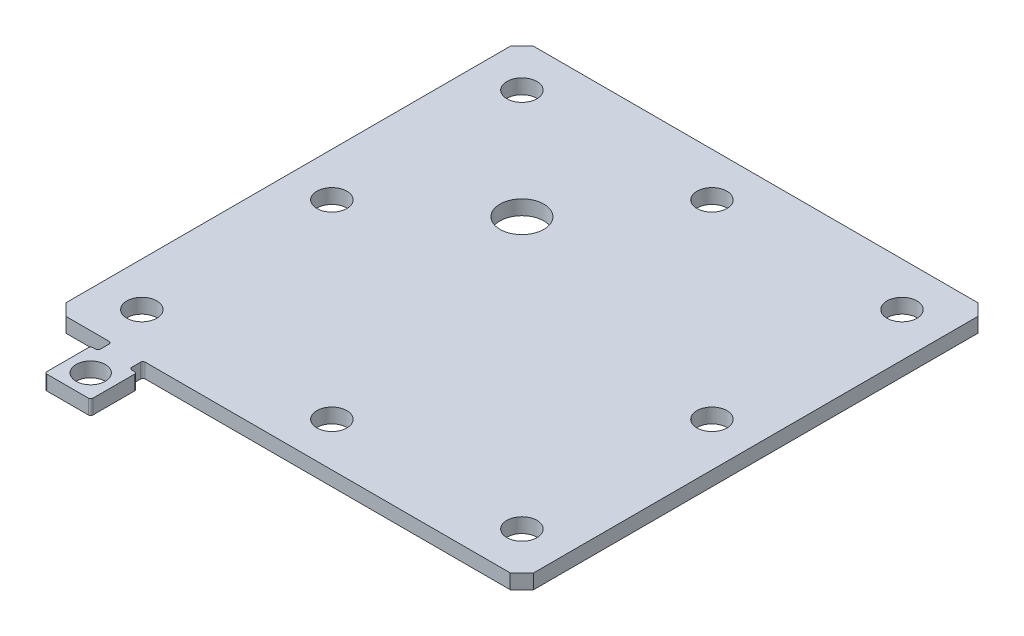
ISO-10303-21;
HEADER;
FILE_DESCRIPTION(('STEP AP214'),'2;1');
FILE_NAME('part.step','',(''),(''),'','','');
FILE_SCHEMA(('AUTOMOTIVE_DESIGN { 1 0 10303 214 1 1 1 1 }'));
ENDSEC;
DATA;
#1=APPLICATION_CONTEXT('core data for automotive mechanical design processes');
#2=APPLICATION_PROTOCOL_DEFINITION('international standard','automotive_design',2000,#1);
#3=PRODUCT_CONTEXT('',#1,'mechanical');
#4=PRODUCT('Part','Part','',(#3));
#5=PRODUCT_RELATED_PRODUCT_CATEGORY('part','',(#4));
#6=PRODUCT_DEFINITION_FORMATION('','',#4);
#7=PRODUCT_DEFINITION_CONTEXT('part definition',#1,'design');
#8=PRODUCT_DEFINITION('design','',#6,#7);
#9=PRODUCT_DEFINITION_SHAPE('','',#8);
#10=(LENGTH_UNIT() NAMED_UNIT(*) SI_UNIT(.MILLI.,.METRE.));
#11=(NAMED_UNIT(*) PLANE_ANGLE_UNIT() SI_UNIT($,.RADIAN.));
#12=(NAMED_UNIT(*) SI_UNIT($,.STERADIAN.) SOLID_ANGLE_UNIT());
#13=UNCERTAINTY_MEASURE_WITH_UNIT(LENGTH_MEASURE(1.E-05),#10,'distance_accuracy_value','');
#14=(GEOMETRIC_REPRESENTATION_CONTEXT(3) GLOBAL_UNCERTAINTY_ASSIGNED_CONTEXT((#13)) GLOBAL_UNIT_ASSIGNED_CONTEXT((#10,
#11,#12)) REPRESENTATION_CONTEXT('',''));
#15=CARTESIAN_POINT('',(0.,0.,0.));
#16=DIRECTION('',(0.,0.,1.));
#17=DIRECTION('',(1.,0.,0.));
#18=AXIS2_PLACEMENT_3D('',#15,#16,#17);
#19=CARTESIAN_POINT('',(46.012230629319,3.175,44.6508696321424));
#20=DIRECTION('',(0.,1.,0.));
#21=DIRECTION('',(0.,0.,1.));
#22=AXIS2_PLACEMENT_3D('',#19,#20,#21);
#23=PLANE('',#22);
#24=CARTESIAN_POINT('',(67.974730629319,3.175,-27.0496638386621));
#25=DIRECTION('',(0.,1.,0.));
#26=DIRECTION('',(0.,0.,1.));
#27=AXIS2_PLACEMENT_3D('',#24,#25,#26);
#28=CIRCLE('',#27,4.7625);
#29=CARTESIAN_POINT('',(67.974730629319,3.175,-22.2871638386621));
#30=VERTEX_POINT('',#29);
#31=EDGE_CURVE('E475',#30,#30,#28,.T.);
#32=ORIENTED_EDGE('',*,*,#31,.F.);
#33=EDGE_LOOP('',(#32));
#34=FACE_BOUND('',#33,.T.);
#35=CARTESIAN_POINT('',(85.437230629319,3.175,-50.8621638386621));
#36=DIRECTION('',(0.,1.,0.));
#37=DIRECTION('',(0.,0.,1.));
#38=AXIS2_PLACEMENT_3D('',#35,#36,#37);
#39=CIRCLE('',#38,3.2639);
#40=CARTESIAN_POINT('',(85.437230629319,3.175,-47.5982638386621));
#41=VERTEX_POINT('',#40);
#42=EDGE_CURVE('E487',#41,#41,#39,.T.);
#43=ORIENTED_EDGE('',*,*,#42,.F.);
#44=EDGE_LOOP('',(#43));
#45=FACE_BOUND('',#44,.T.);
#46=CARTESIAN_POINT('',(126.712230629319,3.175,-9.58716383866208));
#47=DIRECTION('',(0.,1.,0.));
#48=DIRECTION('',(0.,0.,1.));
#49=AXIS2_PLACEMENT_3D('',#46,#47,#48);
#50=CIRCLE('',#49,3.26390000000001);
#51=CARTESIAN_POINT('',(126.712230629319,3.175,-6.32326383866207));
#52=VERTEX_POINT('',#51);
#53=EDGE_CURVE('E499',#52,#52,#50,.T.);
#54=ORIENTED_EDGE('',*,*,#53,.F.);
#55=EDGE_LOOP('',(#54));
#56=FACE_BOUND('',#55,.T.);
#57=CARTESIAN_POINT('',(85.437230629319,3.175,31.6878361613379));
#58=DIRECTION('',(0.,1.,0.));
#59=DIRECTION('',(0.,0.,1.));
#60=AXIS2_PLACEMENT_3D('',#57,#58,#59);
#61=CIRCLE('',#60,3.2639);
#62=CARTESIAN_POINT('',(85.437230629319,3.175,34.9517361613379));
#63=VERTEX_POINT('',#62);
#64=EDGE_CURVE('E511',#63,#63,#61,.T.);
#65=ORIENTED_EDGE('',*,*,#64,.F.);
#66=EDGE_LOOP('',(#65));
#67=FACE_BOUND('',#66,.T.);
#68=CARTESIAN_POINT('',(44.162230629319,3.175,-9.58716383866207));
#69=DIRECTION('',(0.,1.,0.));
#70=DIRECTION('',(0.,0.,1.));
#71=AXIS2_PLACEMENT_3D('',#68,#69,#70);
#72=CIRCLE('',#71,3.2639);
#73=CARTESIAN_POINT('',(44.162230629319,3.175,-6.32326383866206));
#74=VERTEX_POINT('',#73);
#75=EDGE_CURVE('E234',#74,#74,#72,.T.);
#76=ORIENTED_EDGE('',*,*,#75,.F.);
#77=EDGE_LOOP('',(#76));
#78=FACE_BOUND('',#77,.T.);
#79=CARTESIAN_POINT('',(46.012230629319,3.175,44.6508696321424));
#80=DIRECTION('',(0.,1.,0.));
#81=DIRECTION('',(0.,0.,1.));
#82=AXIS2_PLACEMENT_3D('',#79,#80,#81);
#83=CIRCLE('',#82,0.5);
#84=CARTESIAN_POINT('',(46.012230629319,3.175,44.1508696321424));
#85=VERTEX_POINT('',#84);
#86=CARTESIAN_POINT('',(45.512230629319,3.175,44.6508696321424));
#87=VERTEX_POINT('',#86);
#88=EDGE_CURVE('E277',#85,#87,#83,.T.);
#89=ORIENTED_EDGE('',*,*,#88,.T.);
#90=DIRECTION('',(0.,0.,1.));
#91=VECTOR('',#90,1.);
#92=CARTESIAN_POINT('',(45.512230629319,3.175,44.6508696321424));
#93=LINE('',#92,#91);
#94=CARTESIAN_POINT('',(45.512230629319,3.175,53.6508696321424));
#95=VERTEX_POINT('',#94);
#96=EDGE_CURVE('E145',#87,#95,#93,.T.);
#97=ORIENTED_EDGE('',*,*,#96,.T.);
#98=CARTESIAN_POINT('',(46.012230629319,3.175,53.6508696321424));
#99=DIRECTION('',(0.,1.,0.));
#100=DIRECTION('',(0.,0.,1.));
#101=AXIS2_PLACEMENT_3D('',#98,#99,#100);
#102=CIRCLE('',#101,0.5);
#103=CARTESIAN_POINT('',(46.012230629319,3.175,54.1508696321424));
#104=VERTEX_POINT('',#103);
#105=EDGE_CURVE('E340',#95,#104,#102,.T.);
#106=ORIENTED_EDGE('',*,*,#105,.T.);
#107=DIRECTION('',(1.,0.,0.));
#108=VECTOR('',#107,1.);
#109=CARTESIAN_POINT('',(46.012230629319,3.175,54.1508696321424));
#110=LINE('',#109,#108);
#111=CARTESIAN_POINT('',(55.012230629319,3.175,54.1508696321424));
#112=VERTEX_POINT('',#111);
#113=EDGE_CURVE('E359',#104,#112,#110,.T.);
#114=ORIENTED_EDGE('',*,*,#113,.T.);
#115=CARTESIAN_POINT('',(55.012230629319,3.175,53.6508696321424));
#116=DIRECTION('',(0.,1.,0.));
#117=DIRECTION('',(0.,0.,1.));
#118=AXIS2_PLACEMENT_3D('',#115,#116,#117);
#119=CIRCLE('',#118,0.5);
#120=CARTESIAN_POINT('',(55.512230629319,3.175,53.6508696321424));
#121=VERTEX_POINT('',#120);
#122=EDGE_CURVE('E356',#112,#121,#119,.T.);
#123=ORIENTED_EDGE('',*,*,#122,.T.);
#124=DIRECTION('',(0.,0.,-1.));
#125=VECTOR('',#124,1.);
#126=CARTESIAN_POINT('',(55.512230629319,3.175,53.6508696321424));
#127=LINE('',#126,#125);
#128=CARTESIAN_POINT('',(55.512230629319,3.175,44.6508696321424));
#129=VERTEX_POINT('',#128);
#130=EDGE_CURVE('E358',#121,#129,#127,.T.);
#131=ORIENTED_EDGE('',*,*,#130,.T.);
#132=CARTESIAN_POINT('',(55.012230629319,3.175,44.6508696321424));
#133=DIRECTION('',(0.,1.,0.));
#134=DIRECTION('',(0.,0.,1.));
#135=AXIS2_PLACEMENT_3D('',#132,#133,#134);
#136=CIRCLE('',#135,0.5);
#137=CARTESIAN_POINT('',(55.012230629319,3.175,44.1508696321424));
#138=VERTEX_POINT('',#137);
#139=EDGE_CURVE('E361',#129,#138,#136,.T.);
#140=ORIENTED_EDGE('',*,*,#139,.T.);
#141=DIRECTION('',(-1.,0.,0.));
#142=VECTOR('',#141,1.);
#143=CARTESIAN_POINT('',(55.012230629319,3.175,44.1508696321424));
#144=LINE('',#143,#142);
#145=CARTESIAN_POINT('',(54.4247306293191,3.175,44.1508696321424));
#146=VERTEX_POINT('',#145);
#147=EDGE_CURVE('E367',#138,#146,#144,.T.);
#148=ORIENTED_EDGE('',*,*,#147,.T.);
#149=CARTESIAN_POINT('',(54.4247306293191,3.175,43.6508696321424));
#150=DIRECTION('',(0.,-1.,0.));
#151=DIRECTION('',(0.,0.,1.));
#152=AXIS2_PLACEMENT_3D('',#149,#150,#151);
#153=CIRCLE('',#152,0.5);
#154=CARTESIAN_POINT('',(53.9247306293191,3.175,43.6508696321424));
#155=VERTEX_POINT('',#154);
#156=EDGE_CURVE('E369',#146,#155,#153,.T.);
#157=ORIENTED_EDGE('',*,*,#156,.T.);
#158=DIRECTION('',(0.,0.,-1.));
#159=VECTOR('',#158,1.);
#160=CARTESIAN_POINT('',(53.9247306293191,3.175,43.6508696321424));
#161=LINE('',#160,#159);
#162=CARTESIAN_POINT('',(53.9247306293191,3.175,41.7128361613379));
#163=VERTEX_POINT('',#162);
#164=EDGE_CURVE('E371',#155,#163,#161,.T.);
#165=ORIENTED_EDGE('',*,*,#164,.T.);
#166=CARTESIAN_POINT('',(54.4247306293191,3.175,41.7128361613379));
#167=DIRECTION('',(0.,-1.,0.));
#168=DIRECTION('',(0.,0.,1.));
#169=AXIS2_PLACEMENT_3D('',#166,#167,#168);
#170=CIRCLE('',#169,0.5);
#171=CARTESIAN_POINT('',(54.4247306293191,3.175,41.2128361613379));
#172=VERTEX_POINT('',#171);
#173=EDGE_CURVE('E373',#163,#172,#170,.T.);
#174=ORIENTED_EDGE('',*,*,#173,.T.);
#175=DIRECTION('',(1.,0.,0.));
#176=VECTOR('',#175,1.);
#177=CARTESIAN_POINT('',(54.4247306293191,3.175,41.2128361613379));
#178=LINE('',#177,#176);
#179=CARTESIAN_POINT('',(133.697230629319,3.175,41.2128361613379));
#180=VERTEX_POINT('',#179);
#181=EDGE_CURVE('E375',#172,#180,#178,.T.);
#182=ORIENTED_EDGE('',*,*,#181,.T.);
#183=DIRECTION('',(0.70710678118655,0.,-0.707106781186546));
#184=VECTOR('',#183,1.);
#185=CARTESIAN_POINT('',(133.697230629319,3.175,41.2128361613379));
#186=LINE('',#185,#184);
#187=CARTESIAN_POINT('',(136.237230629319,3.175,38.6728361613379));
#188=VERTEX_POINT('',#187);
#189=EDGE_CURVE('E377',#180,#188,#186,.T.);
#190=ORIENTED_EDGE('',*,*,#189,.T.);
#191=DIRECTION('',(0.,0.,-1.));
#192=VECTOR('',#191,1.);
#193=CARTESIAN_POINT('',(136.237230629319,3.175,38.6728361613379));
#194=LINE('',#193,#192);
#195=CARTESIAN_POINT('',(136.237230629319,3.175,-57.8471638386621));
#196=VERTEX_POINT('',#195);
#197=EDGE_CURVE('E379',#188,#196,#194,.T.);
#198=ORIENTED_EDGE('',*,*,#197,.T.);
#199=DIRECTION('',(-0.70710678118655,0.,-0.707106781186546));
#200=VECTOR('',#199,1.);
#201=CARTESIAN_POINT('',(136.237230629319,3.175,-57.8471638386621));
#202=LINE('',#201,#200);
#203=CARTESIAN_POINT('',(133.697230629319,3.175,-60.3871638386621));
#204=VERTEX_POINT('',#203);
#205=EDGE_CURVE('E381',#196,#204,#202,.T.);
#206=ORIENTED_EDGE('',*,*,#205,.T.);
#207=DIRECTION('',(-1.,0.,0.));
#208=VECTOR('',#207,1.);
#209=CARTESIAN_POINT('',(133.697230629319,3.175,-60.3871638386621));
#210=LINE('',#209,#208);
#211=CARTESIAN_POINT('',(37.177230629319,3.175,-60.3871638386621));
#212=VERTEX_POINT('',#211);
#213=EDGE_CURVE('E383',#204,#212,#210,.T.);
#214=ORIENTED_EDGE('',*,*,#213,.T.);
#215=DIRECTION('',(-0.707106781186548,0.,0.707106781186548));
#216=VECTOR('',#215,1.);
#217=CARTESIAN_POINT('',(37.177230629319,3.175,-60.3871638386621));
#218=LINE('',#217,#216);
#219=CARTESIAN_POINT('',(34.637230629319,3.175,-57.8471638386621));
#220=VERTEX_POINT('',#219);
#221=EDGE_CURVE('E385',#212,#220,#218,.T.);
#222=ORIENTED_EDGE('',*,*,#221,.T.);
#223=DIRECTION('',(0.,0.,1.));
#224=VECTOR('',#223,1.);
#225=CARTESIAN_POINT('',(34.637230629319,3.175,-57.8471638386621));
#226=LINE('',#225,#224);
#227=CARTESIAN_POINT('',(34.637230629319,3.175,38.6728361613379));
#228=VERTEX_POINT('',#227);
#229=EDGE_CURVE('E387',#220,#228,#226,.T.);
#230=ORIENTED_EDGE('',*,*,#229,.T.);
#231=DIRECTION('',(0.707106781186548,0.,0.707106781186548));
#232=VECTOR('',#231,1.);
#233=CARTESIAN_POINT('',(34.637230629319,3.175,38.6728361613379));
#234=LINE('',#233,#232);
#235=CARTESIAN_POINT('',(37.177230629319,3.175,41.2128361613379));
#236=VERTEX_POINT('',#235);
#237=EDGE_CURVE('E389',#228,#236,#234,.T.);
#238=ORIENTED_EDGE('',*,*,#237,.T.);
#239=DIRECTION('',(1.,0.,0.));
#240=VECTOR('',#239,1.);
#241=CARTESIAN_POINT('',(37.177230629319,3.175,41.2128361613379));
#242=LINE('',#241,#240);
#243=CARTESIAN_POINT('',(46.599730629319,3.175,41.2128361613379));
#244=VERTEX_POINT('',#243);
#245=EDGE_CURVE('E391',#236,#244,#242,.T.);
#246=ORIENTED_EDGE('',*,*,#245,.T.);
#247=CARTESIAN_POINT('',(46.599730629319,3.175,41.7128361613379));
#248=DIRECTION('',(0.,-1.,0.));
#249=DIRECTION('',(0.,0.,1.));
#250=AXIS2_PLACEMENT_3D('',#247,#248,#249);
#251=CIRCLE('',#250,0.5);
#252=CARTESIAN_POINT('',(47.099730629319,3.175,41.7128361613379));
#253=VERTEX_POINT('',#252);
#254=EDGE_CURVE('E212',#244,#253,#251,.T.);
#255=ORIENTED_EDGE('',*,*,#254,.T.);
#256=DIRECTION('',(0.,0.,1.));
#257=VECTOR('',#256,1.);
#258=CARTESIAN_POINT('',(47.099730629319,3.175,41.7128361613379));
#259=LINE('',#258,#257);
#260=CARTESIAN_POINT('',(47.099730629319,3.175,43.6508696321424));
#261=VERTEX_POINT('',#260);
#262=EDGE_CURVE('E206',#253,#261,#259,.T.);
#263=ORIENTED_EDGE('',*,*,#262,.T.);
#264=CARTESIAN_POINT('',(46.599730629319,3.175,43.6508696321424));
#265=DIRECTION('',(0.,-1.,0.));
#266=DIRECTION('',(0.,0.,1.));
#267=AXIS2_PLACEMENT_3D('',#264,#265,#266);
#268=CIRCLE('',#267,0.5);
#269=CARTESIAN_POINT('',(46.599730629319,3.175,44.1508696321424));
#270=VERTEX_POINT('',#269);
#271=EDGE_CURVE('E210',#261,#270,#268,.T.);
#272=ORIENTED_EDGE('',*,*,#271,.T.);
#273=DIRECTION('',(-1.,0.,0.));
#274=VECTOR('',#273,1.);
#275=CARTESIAN_POINT('',(46.599730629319,3.175,44.1508696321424));
#276=LINE('',#275,#274);
#277=EDGE_CURVE('E54',#270,#85,#276,.T.);
#278=ORIENTED_EDGE('',*,*,#277,.T.);
#279=EDGE_LOOP('',(#89,#97,#106,#114,#123,#131,#140,#148,#157,#165,#174,#182,#190,#198,#206,
#214,#222,#230,#238,#246,#255,#263,#272,#278));
#280=FACE_BOUND('',#279,.T.);
#281=CARTESIAN_POINT('',(44.162230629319,3.175,31.6878361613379));
#282=DIRECTION('',(0.,1.,0.));
#283=DIRECTION('',(0.,0.,1.));
#284=AXIS2_PLACEMENT_3D('',#281,#282,#283);
#285=CIRCLE('',#284,3.2639);
#286=CARTESIAN_POINT('',(44.162230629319,3.175,34.9517361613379));
#287=VERTEX_POINT('',#286);
#288=EDGE_CURVE('E517',#287,#287,#285,.T.);
#289=ORIENTED_EDGE('',*,*,#288,.F.);
#290=EDGE_LOOP('',(#289));
#291=FACE_BOUND('',#290,.T.);
#292=CARTESIAN_POINT('',(126.712230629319,3.175,31.6878361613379));
#293=DIRECTION('',(0.,1.,0.));
#294=DIRECTION('',(0.,0.,1.));
#295=AXIS2_PLACEMENT_3D('',#292,#293,#294);
#296=CIRCLE('',#295,3.26390000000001);
#297=CARTESIAN_POINT('',(126.712230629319,3.175,34.9517361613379));
#298=VERTEX_POINT('',#297);
#299=EDGE_CURVE('E505',#298,#298,#296,.T.);
#300=ORIENTED_EDGE('',*,*,#299,.F.);
#301=EDGE_LOOP('',(#300));
#302=FACE_BOUND('',#301,.T.);
#303=CARTESIAN_POINT('',(126.712230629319,3.175,-50.8621638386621));
#304=DIRECTION('',(0.,1.,0.));
#305=DIRECTION('',(0.,0.,1.));
#306=AXIS2_PLACEMENT_3D('',#303,#304,#305);
#307=CIRCLE('',#306,3.26390000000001);
#308=CARTESIAN_POINT('',(126.712230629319,3.175,-47.5982638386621));
#309=VERTEX_POINT('',#308);
#310=EDGE_CURVE('E493',#309,#309,#307,.T.);
#311=ORIENTED_EDGE('',*,*,#310,.F.);
#312=EDGE_LOOP('',(#311));
#313=FACE_BOUND('',#312,.T.);
#314=CARTESIAN_POINT('',(44.162230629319,3.175,-50.8621638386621));
#315=DIRECTION('',(0.,1.,0.));
#316=DIRECTION('',(0.,0.,1.));
#317=AXIS2_PLACEMENT_3D('',#314,#315,#316);
#318=CIRCLE('',#317,3.2639);
#319=CARTESIAN_POINT('',(44.162230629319,3.175,-47.5982638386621));
#320=VERTEX_POINT('',#319);
#321=EDGE_CURVE('E481',#320,#320,#318,.T.);
#322=ORIENTED_EDGE('',*,*,#321,.F.);
#323=EDGE_LOOP('',(#322));
#324=FACE_BOUND('',#323,.T.);
#325=CARTESIAN_POINT('',(50.512230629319,3.175,49.1508696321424));
#326=DIRECTION('',(0.,1.,0.));
#327=DIRECTION('',(0.,0.,1.));
#328=AXIS2_PLACEMENT_3D('',#325,#326,#327);
#329=CIRCLE('',#328,3.175);
#330=CARTESIAN_POINT('',(50.512230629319,3.175,52.3258696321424));
#331=VERTEX_POINT('',#330);
#332=EDGE_CURVE('E466',#331,#331,#329,.T.);
#333=ORIENTED_EDGE('',*,*,#332,.F.);
#334=EDGE_LOOP('',(#333));
#335=FACE_BOUND('',#334,.T.);
#336=ADVANCED_FACE('F37',(#34,#45,#56,#67,#78,#280,#291,#302,#313,#324,#335),#23,.T.);
#337=CARTESIAN_POINT('',(46.012230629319,0.,44.6508696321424));
#338=DIRECTION('',(0.,1.,0.));
#339=DIRECTION('',(0.,0.,1.));
#340=AXIS2_PLACEMENT_3D('',#337,#338,#339);
#341=PLANE('',#340);
#342=CARTESIAN_POINT('',(46.012230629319,0.,44.6508696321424));
#343=DIRECTION('',(0.,1.,0.));
#344=DIRECTION('',(0.,0.,1.));
#345=AXIS2_PLACEMENT_3D('',#342,#343,#344);
#346=CIRCLE('',#345,0.5);
#347=CARTESIAN_POINT('',(46.012230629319,0.,44.1508696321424));
#348=VERTEX_POINT('',#347);
#349=CARTESIAN_POINT('',(45.512230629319,0.,44.6508696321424));
#350=VERTEX_POINT('',#349);
#351=EDGE_CURVE('E230',#348,#350,#346,.T.);
#352=ORIENTED_EDGE('',*,*,#351,.F.);
#353=DIRECTION('',(-1.,0.,0.));
#354=VECTOR('',#353,1.);
#355=CARTESIAN_POINT('',(46.599730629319,0.,44.1508696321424));
#356=LINE('',#355,#354);
#357=CARTESIAN_POINT('',(46.599730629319,0.,44.1508696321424));
#358=VERTEX_POINT('',#357);
#359=EDGE_CURVE('E137',#358,#348,#356,.T.);
#360=ORIENTED_EDGE('',*,*,#359,.F.);
#361=CARTESIAN_POINT('',(46.599730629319,0.,43.6508696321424));
#362=DIRECTION('',(0.,-1.,0.));
#363=DIRECTION('',(0.,0.,1.));
#364=AXIS2_PLACEMENT_3D('',#361,#362,#363);
#365=CIRCLE('',#364,0.5);
#366=CARTESIAN_POINT('',(47.099730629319,0.,43.6508696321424));
#367=VERTEX_POINT('',#366);
#368=EDGE_CURVE('E131',#367,#358,#365,.T.);
#369=ORIENTED_EDGE('',*,*,#368,.F.);
#370=DIRECTION('',(0.,0.,1.));
#371=VECTOR('',#370,1.);
#372=CARTESIAN_POINT('',(47.099730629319,0.,41.7128361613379));
#373=LINE('',#372,#371);
#374=CARTESIAN_POINT('',(47.099730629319,0.,41.7128361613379));
#375=VERTEX_POINT('',#374);
#376=EDGE_CURVE('E220',#375,#367,#373,.T.);
#377=ORIENTED_EDGE('',*,*,#376,.F.);
#378=CARTESIAN_POINT('',(46.599730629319,0.,41.7128361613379));
#379=DIRECTION('',(0.,-1.,0.));
#380=DIRECTION('',(0.,0.,1.));
#381=AXIS2_PLACEMENT_3D('',#378,#379,#380);
#382=CIRCLE('',#381,0.5);
#383=CARTESIAN_POINT('',(46.599730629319,0.,41.2128361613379));
#384=VERTEX_POINT('',#383);
#385=EDGE_CURVE('E272',#384,#375,#382,.T.);
#386=ORIENTED_EDGE('',*,*,#385,.F.);
#387=DIRECTION('',(1.,0.,0.));
#388=VECTOR('',#387,1.);
#389=CARTESIAN_POINT('',(37.177230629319,0.,41.2128361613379));
#390=LINE('',#389,#388);
#391=CARTESIAN_POINT('',(37.177230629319,0.,41.2128361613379));
#392=VERTEX_POINT('',#391);
#393=EDGE_CURVE('E270',#392,#384,#390,.T.);
#394=ORIENTED_EDGE('',*,*,#393,.F.);
#395=DIRECTION('',(0.707106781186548,0.,0.707106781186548));
#396=VECTOR('',#395,1.);
#397=CARTESIAN_POINT('',(34.637230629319,0.,38.6728361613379));
#398=LINE('',#397,#396);
#399=CARTESIAN_POINT('',(34.637230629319,0.,38.6728361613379));
#400=VERTEX_POINT('',#399);
#401=EDGE_CURVE('E268',#400,#392,#398,.T.);
#402=ORIENTED_EDGE('',*,*,#401,.F.);
#403=DIRECTION('',(0.,0.,1.));
#404=VECTOR('',#403,1.);
#405=CARTESIAN_POINT('',(34.637230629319,0.,-57.8471638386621));
#406=LINE('',#405,#404);
#407=CARTESIAN_POINT('',(34.637230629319,0.,-57.8471638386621));
#408=VERTEX_POINT('',#407);
#409=EDGE_CURVE('E266',#408,#400,#406,.T.);
#410=ORIENTED_EDGE('',*,*,#409,.F.);
#411=DIRECTION('',(-0.707106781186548,0.,0.707106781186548));
#412=VECTOR('',#411,1.);
#413=CARTESIAN_POINT('',(37.177230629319,0.,-60.3871638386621));
#414=LINE('',#413,#412);
#415=CARTESIAN_POINT('',(37.177230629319,0.,-60.3871638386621));
#416=VERTEX_POINT('',#415);
#417=EDGE_CURVE('E264',#416,#408,#414,.T.);
#418=ORIENTED_EDGE('',*,*,#417,.F.);
#419=DIRECTION('',(-1.,0.,0.));
#420=VECTOR('',#419,1.);
#421=CARTESIAN_POINT('',(133.697230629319,0.,-60.3871638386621));
#422=LINE('',#421,#420);
#423=CARTESIAN_POINT('',(133.697230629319,0.,-60.3871638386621));
#424=VERTEX_POINT('',#423);
#425=EDGE_CURVE('E262',#424,#416,#422,.T.);
#426=ORIENTED_EDGE('',*,*,#425,.F.);
#427=DIRECTION('',(-0.70710678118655,0.,-0.707106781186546));
#428=VECTOR('',#427,1.);
#429=CARTESIAN_POINT('',(136.237230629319,0.,-57.8471638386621));
#430=LINE('',#429,#428);
#431=CARTESIAN_POINT('',(136.237230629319,0.,-57.8471638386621));
#432=VERTEX_POINT('',#431);
#433=EDGE_CURVE('E260',#432,#424,#430,.T.);
#434=ORIENTED_EDGE('',*,*,#433,.F.);
#435=DIRECTION('',(0.,0.,-1.));
#436=VECTOR('',#435,1.);
#437=CARTESIAN_POINT('',(136.237230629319,0.,38.6728361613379));
#438=LINE('',#437,#436);
#439=CARTESIAN_POINT('',(136.237230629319,0.,38.6728361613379));
#440=VERTEX_POINT('',#439);
#441=EDGE_CURVE('E258',#440,#432,#438,.T.);
#442=ORIENTED_EDGE('',*,*,#441,.F.);
#443=DIRECTION('',(0.70710678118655,0.,-0.707106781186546));
#444=VECTOR('',#443,1.);
#445=CARTESIAN_POINT('',(133.697230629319,0.,41.2128361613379));
#446=LINE('',#445,#444);
#447=CARTESIAN_POINT('',(133.697230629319,0.,41.2128361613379));
#448=VERTEX_POINT('',#447);
#449=EDGE_CURVE('E256',#448,#440,#446,.T.);
#450=ORIENTED_EDGE('',*,*,#449,.F.);
#451=DIRECTION('',(1.,0.,0.));
#452=VECTOR('',#451,1.);
#453=CARTESIAN_POINT('',(54.4247306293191,0.,41.2128361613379));
#454=LINE('',#453,#452);
#455=CARTESIAN_POINT('',(54.4247306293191,0.,41.2128361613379));
#456=VERTEX_POINT('',#455);
#457=EDGE_CURVE('E254',#456,#448,#454,.T.);
#458=ORIENTED_EDGE('',*,*,#457,.F.);
#459=CARTESIAN_POINT('',(54.4247306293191,0.,41.7128361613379));
#460=DIRECTION('',(0.,-1.,0.));
#461=DIRECTION('',(0.,0.,1.));
#462=AXIS2_PLACEMENT_3D('',#459,#460,#461);
#463=CIRCLE('',#462,0.5);
#464=CARTESIAN_POINT('',(53.9247306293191,0.,41.7128361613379));
#465=VERTEX_POINT('',#464);
#466=EDGE_CURVE('E252',#465,#456,#463,.T.);
#467=ORIENTED_EDGE('',*,*,#466,.F.);
#468=DIRECTION('',(0.,0.,-1.));
#469=VECTOR('',#468,1.);
#470=CARTESIAN_POINT('',(53.9247306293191,0.,43.6508696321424));
#471=LINE('',#470,#469);
#472=CARTESIAN_POINT('',(53.9247306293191,0.,43.6508696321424));
#473=VERTEX_POINT('',#472);
#474=EDGE_CURVE('E250',#473,#465,#471,.T.);
#475=ORIENTED_EDGE('',*,*,#474,.F.);
#476=CARTESIAN_POINT('',(54.4247306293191,0.,43.6508696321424));
#477=DIRECTION('',(0.,-1.,0.));
#478=DIRECTION('',(0.,0.,1.));
#479=AXIS2_PLACEMENT_3D('',#476,#477,#478);
#480=CIRCLE('',#479,0.5);
#481=CARTESIAN_POINT('',(54.4247306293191,0.,44.1508696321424));
#482=VERTEX_POINT('',#481);
#483=EDGE_CURVE('E248',#482,#473,#480,.T.);
#484=ORIENTED_EDGE('',*,*,#483,.F.);
#485=DIRECTION('',(-1.,0.,0.));
#486=VECTOR('',#485,1.);
#487=CARTESIAN_POINT('',(55.012230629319,0.,44.1508696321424));
#488=LINE('',#487,#486);
#489=CARTESIAN_POINT('',(55.012230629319,0.,44.1508696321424));
#490=VERTEX_POINT('',#489);
#491=EDGE_CURVE('E246',#490,#482,#488,.T.);
#492=ORIENTED_EDGE('',*,*,#491,.F.);
#493=CARTESIAN_POINT('',(55.012230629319,0.,44.6508696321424));
#494=DIRECTION('',(0.,1.,0.));
#495=DIRECTION('',(0.,0.,1.));
#496=AXIS2_PLACEMENT_3D('',#493,#494,#495);
#497=CIRCLE('',#496,0.5);
#498=CARTESIAN_POINT('',(55.512230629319,0.,44.6508696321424));
#499=VERTEX_POINT('',#498);
#500=EDGE_CURVE('E244',#499,#490,#497,.T.);
#501=ORIENTED_EDGE('',*,*,#500,.F.);
#502=DIRECTION('',(0.,0.,-1.));
#503=VECTOR('',#502,1.);
#504=CARTESIAN_POINT('',(55.512230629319,0.,53.6508696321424));
#505=LINE('',#504,#503);
#506=CARTESIAN_POINT('',(55.512230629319,0.,53.6508696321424));
#507=VERTEX_POINT('',#506);
#508=EDGE_CURVE('E242',#507,#499,#505,.T.);
#509=ORIENTED_EDGE('',*,*,#508,.F.);
#510=CARTESIAN_POINT('',(55.012230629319,0.,53.6508696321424));
#511=DIRECTION('',(0.,1.,0.));
#512=DIRECTION('',(0.,0.,1.));
#513=AXIS2_PLACEMENT_3D('',#510,#511,#512);
#514=CIRCLE('',#513,0.5);
#515=CARTESIAN_POINT('',(55.012230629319,0.,54.1508696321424));
#516=VERTEX_POINT('',#515);
#517=EDGE_CURVE('E240',#516,#507,#514,.T.);
#518=ORIENTED_EDGE('',*,*,#517,.F.);
#519=DIRECTION('',(1.,0.,0.));
#520=VECTOR('',#519,1.);
#521=CARTESIAN_POINT('',(46.012230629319,0.,54.1508696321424));
#522=LINE('',#521,#520);
#523=CARTESIAN_POINT('',(46.012230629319,0.,54.1508696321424));
#524=VERTEX_POINT('',#523);
#525=EDGE_CURVE('E238',#524,#516,#522,.T.);
#526=ORIENTED_EDGE('',*,*,#525,.F.);
#527=CARTESIAN_POINT('',(46.012230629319,0.,53.6508696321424));
#528=DIRECTION('',(0.,1.,0.));
#529=DIRECTION('',(0.,0.,1.));
#530=AXIS2_PLACEMENT_3D('',#527,#528,#529);
#531=CIRCLE('',#530,0.5);
#532=CARTESIAN_POINT('',(45.512230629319,0.,53.6508696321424));
#533=VERTEX_POINT('',#532);
#534=EDGE_CURVE('E236',#533,#524,#531,.T.);
#535=ORIENTED_EDGE('',*,*,#534,.F.);
#536=DIRECTION('',(0.,0.,1.));
#537=VECTOR('',#536,1.);
#538=CARTESIAN_POINT('',(45.512230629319,0.,44.6508696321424));
#539=LINE('',#538,#537);
#540=EDGE_CURVE('E233',#350,#533,#539,.T.);
#541=ORIENTED_EDGE('',*,*,#540,.F.);
#542=EDGE_LOOP('',(#352,#360,#369,#377,#386,#394,#402,#410,#418,#426,#434,#442,#450,#458,#467,
#475,#484,#492,#501,#509,#518,#526,#535,#541));
#543=FACE_BOUND('',#542,.T.);
#544=CARTESIAN_POINT('',(44.162230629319,0.,-9.58716383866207));
#545=DIRECTION('',(0.,1.,0.));
#546=DIRECTION('',(0.,0.,1.));
#547=AXIS2_PLACEMENT_3D('',#544,#545,#546);
#548=CIRCLE('',#547,3.2639);
#549=CARTESIAN_POINT('',(44.162230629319,0.,-6.32326383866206));
#550=VERTEX_POINT('',#549);
#551=EDGE_CURVE('E520',#550,#550,#548,.T.);
#552=ORIENTED_EDGE('',*,*,#551,.T.);
#553=EDGE_LOOP('',(#552));
#554=FACE_BOUND('',#553,.T.);
#555=CARTESIAN_POINT('',(44.162230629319,0.,31.6878361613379));
#556=DIRECTION('',(0.,1.,0.));
#557=DIRECTION('',(0.,0.,1.));
#558=AXIS2_PLACEMENT_3D('',#555,#556,#557);
#559=CIRCLE('',#558,3.2639);
#560=CARTESIAN_POINT('',(44.162230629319,0.,34.9517361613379));
#561=VERTEX_POINT('',#560);
#562=EDGE_CURVE('E514',#561,#561,#559,.T.);
#563=ORIENTED_EDGE('',*,*,#562,.T.);
#564=EDGE_LOOP('',(#563));
#565=FACE_BOUND('',#564,.T.);
#566=CARTESIAN_POINT('',(85.437230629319,0.,31.6878361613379));
#567=DIRECTION('',(0.,1.,0.));
#568=DIRECTION('',(0.,0.,1.));
#569=AXIS2_PLACEMENT_3D('',#566,#567,#568);
#570=CIRCLE('',#569,3.2639);
#571=CARTESIAN_POINT('',(85.437230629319,0.,34.9517361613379));
#572=VERTEX_POINT('',#571);
#573=EDGE_CURVE('E508',#572,#572,#570,.T.);
#574=ORIENTED_EDGE('',*,*,#573,.T.);
#575=EDGE_LOOP('',(#574));
#576=FACE_BOUND('',#575,.T.);
#577=CARTESIAN_POINT('',(126.712230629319,0.,31.6878361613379));
#578=DIRECTION('',(0.,1.,0.));
#579=DIRECTION('',(0.,0.,1.));
#580=AXIS2_PLACEMENT_3D('',#577,#578,#579);
#581=CIRCLE('',#580,3.26390000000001);
#582=CARTESIAN_POINT('',(126.712230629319,0.,34.9517361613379));
#583=VERTEX_POINT('',#582);
#584=EDGE_CURVE('E502',#583,#583,#581,.T.);
#585=ORIENTED_EDGE('',*,*,#584,.T.);
#586=EDGE_LOOP('',(#585));
#587=FACE_BOUND('',#586,.T.);
#588=CARTESIAN_POINT('',(126.712230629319,0.,-9.58716383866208));
#589=DIRECTION('',(0.,1.,0.));
#590=DIRECTION('',(0.,0.,1.));
#591=AXIS2_PLACEMENT_3D('',#588,#589,#590);
#592=CIRCLE('',#591,3.26390000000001);
#593=CARTESIAN_POINT('',(126.712230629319,0.,-6.32326383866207));
#594=VERTEX_POINT('',#593);
#595=EDGE_CURVE('E496',#594,#594,#592,.T.);
#596=ORIENTED_EDGE('',*,*,#595,.T.);
#597=EDGE_LOOP('',(#596));
#598=FACE_BOUND('',#597,.T.);
#599=CARTESIAN_POINT('',(126.712230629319,0.,-50.8621638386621));
#600=DIRECTION('',(0.,1.,0.));
#601=DIRECTION('',(0.,0.,1.));
#602=AXIS2_PLACEMENT_3D('',#599,#600,#601);
#603=CIRCLE('',#602,3.26390000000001);
#604=CARTESIAN_POINT('',(126.712230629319,0.,-47.5982638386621));
#605=VERTEX_POINT('',#604);
#606=EDGE_CURVE('E490',#605,#605,#603,.T.);
#607=ORIENTED_EDGE('',*,*,#606,.T.);
#608=EDGE_LOOP('',(#607));
#609=FACE_BOUND('',#608,.T.);
#610=CARTESIAN_POINT('',(85.437230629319,0.,-50.8621638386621));
#611=DIRECTION('',(0.,1.,0.));
#612=DIRECTION('',(0.,0.,1.));
#613=AXIS2_PLACEMENT_3D('',#610,#611,#612);
#614=CIRCLE('',#613,3.2639);
#615=CARTESIAN_POINT('',(85.437230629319,0.,-47.5982638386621));
#616=VERTEX_POINT('',#615);
#617=EDGE_CURVE('E484',#616,#616,#614,.T.);
#618=ORIENTED_EDGE('',*,*,#617,.T.);
#619=EDGE_LOOP('',(#618));
#620=FACE_BOUND('',#619,.T.);
#621=CARTESIAN_POINT('',(44.162230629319,0.,-50.8621638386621));
#622=DIRECTION('',(0.,1.,0.));
#623=DIRECTION('',(0.,0.,1.));
#624=AXIS2_PLACEMENT_3D('',#621,#622,#623);
#625=CIRCLE('',#624,3.2639);
#626=CARTESIAN_POINT('',(44.162230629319,0.,-47.5982638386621));
#627=VERTEX_POINT('',#626);
#628=EDGE_CURVE('E478',#627,#627,#625,.T.);
#629=ORIENTED_EDGE('',*,*,#628,.T.);
#630=EDGE_LOOP('',(#629));
#631=FACE_BOUND('',#630,.T.);
#632=CARTESIAN_POINT('',(67.974730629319,0.,-27.0496638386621));
#633=DIRECTION('',(0.,1.,0.));
#634=DIRECTION('',(0.,0.,1.));
#635=AXIS2_PLACEMENT_3D('',#632,#633,#634);
#636=CIRCLE('',#635,4.7625);
#637=CARTESIAN_POINT('',(67.974730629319,0.,-22.2871638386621));
#638=VERTEX_POINT('',#637);
#639=EDGE_CURVE('E472',#638,#638,#636,.T.);
#640=ORIENTED_EDGE('',*,*,#639,.T.);
#641=EDGE_LOOP('',(#640));
#642=FACE_BOUND('',#641,.T.);
#643=CARTESIAN_POINT('',(50.512230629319,0.,49.1508696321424));
#644=DIRECTION('',(0.,1.,0.));
#645=DIRECTION('',(0.,0.,1.));
#646=AXIS2_PLACEMENT_3D('',#643,#644,#645);
#647=CIRCLE('',#646,3.175);
#648=CARTESIAN_POINT('',(50.512230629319,0.,52.3258696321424));
#649=VERTEX_POINT('',#648);
#650=EDGE_CURVE('E469',#649,#649,#647,.T.);
#651=ORIENTED_EDGE('',*,*,#650,.T.);
#652=EDGE_LOOP('',(#651));
#653=FACE_BOUND('',#652,.T.);
#654=ADVANCED_FACE('F344',(#543,#554,#565,#576,#587,#598,#609,#620,#631,#642,#653),#341,.F.);
#655=CARTESIAN_POINT('',(46.012230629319,3.175,44.6508696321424));
#656=DIRECTION('',(0.,-1.,0.));
#657=DIRECTION('',(0.,0.,-1.));
#658=AXIS2_PLACEMENT_3D('',#655,#656,#657);
#659=CYLINDRICAL_SURFACE('',#658,0.5);
#660=ORIENTED_EDGE('',*,*,#351,.T.);
#661=DIRECTION('',(0.,-1.,0.));
#662=VECTOR('',#661,1.);
#663=CARTESIAN_POINT('',(45.512230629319,3.175,44.6508696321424));
#664=LINE('',#663,#662);
#665=EDGE_CURVE('E11',#87,#350,#664,.T.);
#666=ORIENTED_EDGE('',*,*,#665,.F.);
#667=ORIENTED_EDGE('',*,*,#88,.F.);
#668=DIRECTION('',(0.,-1.,0.));
#669=VECTOR('',#668,1.);
#670=CARTESIAN_POINT('',(46.012230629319,3.175,44.1508696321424));
#671=LINE('',#670,#669);
#672=EDGE_CURVE('E226',#85,#348,#671,.T.);
#673=ORIENTED_EDGE('',*,*,#672,.T.);
#674=EDGE_LOOP('',(#660,#666,#667,#673));
#675=FACE_BOUND('',#674,.T.);
#676=ADVANCED_FACE('F39',(#675),#659,.T.);
#677=CARTESIAN_POINT('',(45.512230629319,3.175,44.6508696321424));
#678=DIRECTION('',(1.,0.,0.));
#679=DIRECTION('',(0.,0.,-1.));
#680=AXIS2_PLACEMENT_3D('',#677,#678,#679);
#681=PLANE('',#680);
#682=ORIENTED_EDGE('',*,*,#540,.T.);
#683=DIRECTION('',(0.,-1.,0.));
#684=VECTOR('',#683,1.);
#685=CARTESIAN_POINT('',(45.512230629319,3.175,53.6508696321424));
#686=LINE('',#685,#684);
#687=EDGE_CURVE('E46',#95,#533,#686,.T.);
#688=ORIENTED_EDGE('',*,*,#687,.F.);
#689=ORIENTED_EDGE('',*,*,#96,.F.);
#690=ORIENTED_EDGE('',*,*,#665,.T.);
#691=EDGE_LOOP('',(#682,#688,#689,#690));
#692=FACE_BOUND('',#691,.T.);
#693=ADVANCED_FACE('F826',(#692),#681,.F.);
#694=CARTESIAN_POINT('',(46.012230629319,3.175,53.6508696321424));
#695=DIRECTION('',(0.,-1.,0.));
#696=DIRECTION('',(0.,0.,-1.));
#697=AXIS2_PLACEMENT_3D('',#694,#695,#696);
#698=CYLINDRICAL_SURFACE('',#697,0.5);
#699=ORIENTED_EDGE('',*,*,#534,.T.);
#700=DIRECTION('',(0.,-1.,0.));
#701=VECTOR('',#700,1.);
#702=CARTESIAN_POINT('',(46.012230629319,3.175,54.1508696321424));
#703=LINE('',#702,#701);
#704=EDGE_CURVE('E332',#104,#524,#703,.T.);
#705=ORIENTED_EDGE('',*,*,#704,.F.);
#706=ORIENTED_EDGE('',*,*,#105,.F.);
#707=ORIENTED_EDGE('',*,*,#687,.T.);
#708=EDGE_LOOP('',(#699,#705,#706,#707));
#709=FACE_BOUND('',#708,.T.);
#710=ADVANCED_FACE('F338',(#709),#698,.T.);
#711=CARTESIAN_POINT('',(46.012230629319,3.175,54.1508696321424));
#712=DIRECTION('',(0.,0.,-1.));
#713=DIRECTION('',(-1.,0.,0.));
#714=AXIS2_PLACEMENT_3D('',#711,#712,#713);
#715=PLANE('',#714);
#716=ORIENTED_EDGE('',*,*,#525,.T.);
#717=DIRECTION('',(0.,-1.,0.));
#718=VECTOR('',#717,1.);
#719=CARTESIAN_POINT('',(55.012230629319,3.175,54.1508696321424));
#720=LINE('',#719,#718);
#721=EDGE_CURVE('E329',#112,#516,#720,.T.);
#722=ORIENTED_EDGE('',*,*,#721,.F.);
#723=ORIENTED_EDGE('',*,*,#113,.F.);
#724=ORIENTED_EDGE('',*,*,#704,.T.);
#725=EDGE_LOOP('',(#716,#722,#723,#724));
#726=FACE_BOUND('',#725,.T.);
#727=ADVANCED_FACE('F350',(#726),#715,.F.);
#728=CARTESIAN_POINT('',(55.012230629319,3.175,53.6508696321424));
#729=DIRECTION('',(0.,-1.,0.));
#730=DIRECTION('',(0.,0.,-1.));
#731=AXIS2_PLACEMENT_3D('',#728,#729,#730);
#732=CYLINDRICAL_SURFACE('',#731,0.5);
#733=ORIENTED_EDGE('',*,*,#517,.T.);
#734=DIRECTION('',(0.,-1.,0.));
#735=VECTOR('',#734,1.);
#736=CARTESIAN_POINT('',(55.512230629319,3.175,53.6508696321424));
#737=LINE('',#736,#735);
#738=EDGE_CURVE('E326',#121,#507,#737,.T.);
#739=ORIENTED_EDGE('',*,*,#738,.F.);
#740=ORIENTED_EDGE('',*,*,#122,.F.);
#741=ORIENTED_EDGE('',*,*,#721,.T.);
#742=EDGE_LOOP('',(#733,#739,#740,#741));
#743=FACE_BOUND('',#742,.T.);
#744=ADVANCED_FACE('F354',(#743),#732,.T.);
#745=CARTESIAN_POINT('',(55.512230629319,3.175,53.6508696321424));
#746=DIRECTION('',(-1.,0.,0.));
#747=DIRECTION('',(0.,0.,1.));
#748=AXIS2_PLACEMENT_3D('',#745,#746,#747);
#749=PLANE('',#748);
#750=ORIENTED_EDGE('',*,*,#508,.T.);
#751=DIRECTION('',(0.,-1.,0.));
#752=VECTOR('',#751,1.);
#753=CARTESIAN_POINT('',(55.512230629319,3.175,44.6508696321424));
#754=LINE('',#753,#752);
#755=EDGE_CURVE('E323',#129,#499,#754,.T.);
#756=ORIENTED_EDGE('',*,*,#755,.F.);
#757=ORIENTED_EDGE('',*,*,#130,.F.);
#758=ORIENTED_EDGE('',*,*,#738,.T.);
#759=EDGE_LOOP('',(#750,#756,#757,#758));
#760=FACE_BOUND('',#759,.T.);
#761=ADVANCED_FACE('F787',(#760),#749,.F.);
#762=CARTESIAN_POINT('',(55.012230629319,3.175,44.6508696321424));
#763=DIRECTION('',(0.,-1.,0.));
#764=DIRECTION('',(0.,0.,-1.));
#765=AXIS2_PLACEMENT_3D('',#762,#763,#764);
#766=CYLINDRICAL_SURFACE('',#765,0.5);
#767=ORIENTED_EDGE('',*,*,#500,.T.);
#768=DIRECTION('',(0.,-1.,0.));
#769=VECTOR('',#768,1.);
#770=CARTESIAN_POINT('',(55.012230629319,3.175,44.1508696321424));
#771=LINE('',#770,#769);
#772=EDGE_CURVE('E320',#138,#490,#771,.T.);
#773=ORIENTED_EDGE('',*,*,#772,.F.);
#774=ORIENTED_EDGE('',*,*,#139,.F.);
#775=ORIENTED_EDGE('',*,*,#755,.T.);
#776=EDGE_LOOP('',(#767,#773,#774,#775));
#777=FACE_BOUND('',#776,.T.);
#778=ADVANCED_FACE('F776',(#777),#766,.T.);
#779=CARTESIAN_POINT('',(55.012230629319,3.175,44.1508696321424));
#780=DIRECTION('',(0.,0.,1.));
#781=DIRECTION('',(1.,0.,0.));
#782=AXIS2_PLACEMENT_3D('',#779,#780,#781);
#783=PLANE('',#782);
#784=ORIENTED_EDGE('',*,*,#491,.T.);
#785=DIRECTION('',(0.,-1.,0.));
#786=VECTOR('',#785,1.);
#787=CARTESIAN_POINT('',(54.4247306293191,3.175,44.1508696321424));
#788=LINE('',#787,#786);
#789=EDGE_CURVE('E317',#146,#482,#788,.T.);
#790=ORIENTED_EDGE('',*,*,#789,.F.);
#791=ORIENTED_EDGE('',*,*,#147,.F.);
#792=ORIENTED_EDGE('',*,*,#772,.T.);
#793=EDGE_LOOP('',(#784,#790,#791,#792));
#794=FACE_BOUND('',#793,.T.);
#795=ADVANCED_FACE('F765',(#794),#783,.F.);
#796=CARTESIAN_POINT('',(54.4247306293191,3.175,43.6508696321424));
#797=DIRECTION('',(0.,-1.,0.));
#798=DIRECTION('',(0.,0.,-1.));
#799=AXIS2_PLACEMENT_3D('',#796,#797,#798);
#800=CYLINDRICAL_SURFACE('',#799,0.5);
#801=ORIENTED_EDGE('',*,*,#483,.T.);
#802=DIRECTION('',(0.,-1.,0.));
#803=VECTOR('',#802,1.);
#804=CARTESIAN_POINT('',(53.9247306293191,3.175,43.6508696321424));
#805=LINE('',#804,#803);
#806=EDGE_CURVE('E314',#155,#473,#805,.T.);
#807=ORIENTED_EDGE('',*,*,#806,.F.);
#808=ORIENTED_EDGE('',*,*,#156,.F.);
#809=ORIENTED_EDGE('',*,*,#789,.T.);
#810=EDGE_LOOP('',(#801,#807,#808,#809));
#811=FACE_BOUND('',#810,.T.);
#812=ADVANCED_FACE('F754',(#811),#800,.F.);
#813=CARTESIAN_POINT('',(53.9247306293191,3.175,43.6508696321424));
#814=DIRECTION('',(-1.,0.,0.));
#815=DIRECTION('',(0.,0.,1.));
#816=AXIS2_PLACEMENT_3D('',#813,#814,#815);
#817=PLANE('',#816);
#818=ORIENTED_EDGE('',*,*,#474,.T.);
#819=DIRECTION('',(0.,-1.,0.));
#820=VECTOR('',#819,1.);
#821=CARTESIAN_POINT('',(53.9247306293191,3.175,41.7128361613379));
#822=LINE('',#821,#820);
#823=EDGE_CURVE('E311',#163,#465,#822,.T.);
#824=ORIENTED_EDGE('',*,*,#823,.F.);
#825=ORIENTED_EDGE('',*,*,#164,.F.);
#826=ORIENTED_EDGE('',*,*,#806,.T.);
#827=EDGE_LOOP('',(#818,#824,#825,#826));
#828=FACE_BOUND('',#827,.T.);
#829=ADVANCED_FACE('F743',(#828),#817,.F.);
#830=CARTESIAN_POINT('',(54.4247306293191,3.175,41.7128361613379));
#831=DIRECTION('',(0.,-1.,0.));
#832=DIRECTION('',(0.,0.,-1.));
#833=AXIS2_PLACEMENT_3D('',#830,#831,#832);
#834=CYLINDRICAL_SURFACE('',#833,0.5);
#835=ORIENTED_EDGE('',*,*,#466,.T.);
#836=DIRECTION('',(0.,-1.,0.));
#837=VECTOR('',#836,1.);
#838=CARTESIAN_POINT('',(54.4247306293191,3.175,41.2128361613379));
#839=LINE('',#838,#837);
#840=EDGE_CURVE('E308',#172,#456,#839,.T.);
#841=ORIENTED_EDGE('',*,*,#840,.F.);
#842=ORIENTED_EDGE('',*,*,#173,.F.);
#843=ORIENTED_EDGE('',*,*,#823,.T.);
#844=EDGE_LOOP('',(#835,#841,#842,#843));
#845=FACE_BOUND('',#844,.T.);
#846=ADVANCED_FACE('F732',(#845),#834,.F.);
#847=CARTESIAN_POINT('',(54.4247306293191,3.175,41.2128361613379));
#848=DIRECTION('',(0.,0.,-1.));
#849=DIRECTION('',(-1.,0.,0.));
#850=AXIS2_PLACEMENT_3D('',#847,#848,#849);
#851=PLANE('',#850);
#852=ORIENTED_EDGE('',*,*,#457,.T.);
#853=DIRECTION('',(0.,-1.,0.));
#854=VECTOR('',#853,1.);
#855=CARTESIAN_POINT('',(133.697230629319,3.175,41.2128361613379));
#856=LINE('',#855,#854);
#857=EDGE_CURVE('E305',#180,#448,#856,.T.);
#858=ORIENTED_EDGE('',*,*,#857,.F.);
#859=ORIENTED_EDGE('',*,*,#181,.F.);
#860=ORIENTED_EDGE('',*,*,#840,.T.);
#861=EDGE_LOOP('',(#852,#858,#859,#860));
#862=FACE_BOUND('',#861,.T.);
#863=ADVANCED_FACE('F721',(#862),#851,.F.);
#864=CARTESIAN_POINT('',(133.697230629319,3.175,41.2128361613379));
#865=DIRECTION('',(-0.707106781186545,0.,-0.707106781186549));
#866=DIRECTION('',(-0.70710678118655,0.,0.707106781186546));
#867=AXIS2_PLACEMENT_3D('',#864,#865,#866);
#868=PLANE('',#867);
#869=ORIENTED_EDGE('',*,*,#449,.T.);
#870=DIRECTION('',(0.,-1.,0.));
#871=VECTOR('',#870,1.);
#872=CARTESIAN_POINT('',(136.237230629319,3.175,38.6728361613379));
#873=LINE('',#872,#871);
#874=EDGE_CURVE('E302',#188,#440,#873,.T.);
#875=ORIENTED_EDGE('',*,*,#874,.F.);
#876=ORIENTED_EDGE('',*,*,#189,.F.);
#877=ORIENTED_EDGE('',*,*,#857,.T.);
#878=EDGE_LOOP('',(#869,#875,#876,#877));
#879=FACE_BOUND('',#878,.T.);
#880=ADVANCED_FACE('F710',(#879),#868,.F.);
#881=CARTESIAN_POINT('',(136.237230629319,3.175,38.6728361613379));
#882=DIRECTION('',(-1.,0.,0.));
#883=DIRECTION('',(0.,0.,1.));
#884=AXIS2_PLACEMENT_3D('',#881,#882,#883);
#885=PLANE('',#884);
#886=ORIENTED_EDGE('',*,*,#441,.T.);
#887=DIRECTION('',(0.,-1.,0.));
#888=VECTOR('',#887,1.);
#889=CARTESIAN_POINT('',(136.237230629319,3.175,-57.8471638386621));
#890=LINE('',#889,#888);
#891=EDGE_CURVE('E299',#196,#432,#890,.T.);
#892=ORIENTED_EDGE('',*,*,#891,.F.);
#893=ORIENTED_EDGE('',*,*,#197,.F.);
#894=ORIENTED_EDGE('',*,*,#874,.T.);
#895=EDGE_LOOP('',(#886,#892,#893,#894));
#896=FACE_BOUND('',#895,.T.);
#897=ADVANCED_FACE('F699',(#896),#885,.F.);
#898=CARTESIAN_POINT('',(136.237230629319,3.175,-57.8471638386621));
#899=DIRECTION('',(-0.707106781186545,0.,0.707106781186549));
#900=DIRECTION('',(0.70710678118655,0.,0.707106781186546));
#901=AXIS2_PLACEMENT_3D('',#898,#899,#900);
#902=PLANE('',#901);
#903=ORIENTED_EDGE('',*,*,#433,.T.);
#904=DIRECTION('',(0.,-1.,0.));
#905=VECTOR('',#904,1.);
#906=CARTESIAN_POINT('',(133.697230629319,3.175,-60.3871638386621));
#907=LINE('',#906,#905);
#908=EDGE_CURVE('E296',#204,#424,#907,.T.);
#909=ORIENTED_EDGE('',*,*,#908,.F.);
#910=ORIENTED_EDGE('',*,*,#205,.F.);
#911=ORIENTED_EDGE('',*,*,#891,.T.);
#912=EDGE_LOOP('',(#903,#909,#910,#911));
#913=FACE_BOUND('',#912,.T.);
#914=ADVANCED_FACE('F688',(#913),#902,.F.);
#915=CARTESIAN_POINT('',(133.697230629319,3.175,-60.3871638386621));
#916=DIRECTION('',(0.,0.,1.));
#917=DIRECTION('',(1.,0.,0.));
#918=AXIS2_PLACEMENT_3D('',#915,#916,#917);
#919=PLANE('',#918);
#920=ORIENTED_EDGE('',*,*,#425,.T.);
#921=DIRECTION('',(0.,-1.,0.));
#922=VECTOR('',#921,1.);
#923=CARTESIAN_POINT('',(37.177230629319,3.175,-60.3871638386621));
#924=LINE('',#923,#922);
#925=EDGE_CURVE('E293',#212,#416,#924,.T.);
#926=ORIENTED_EDGE('',*,*,#925,.F.);
#927=ORIENTED_EDGE('',*,*,#213,.F.);
#928=ORIENTED_EDGE('',*,*,#908,.T.);
#929=EDGE_LOOP('',(#920,#926,#927,#928));
#930=FACE_BOUND('',#929,.T.);
#931=ADVANCED_FACE('F677',(#930),#919,.F.);
#932=CARTESIAN_POINT('',(37.177230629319,3.175,-60.3871638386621));
#933=DIRECTION('',(0.707106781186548,0.,0.707106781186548));
#934=DIRECTION('',(0.707106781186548,0.,-0.707106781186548));
#935=AXIS2_PLACEMENT_3D('',#932,#933,#934);
#936=PLANE('',#935);
#937=ORIENTED_EDGE('',*,*,#417,.T.);
#938=DIRECTION('',(0.,-1.,0.));
#939=VECTOR('',#938,1.);
#940=CARTESIAN_POINT('',(34.637230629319,3.175,-57.8471638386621));
#941=LINE('',#940,#939);
#942=EDGE_CURVE('E290',#220,#408,#941,.T.);
#943=ORIENTED_EDGE('',*,*,#942,.F.);
#944=ORIENTED_EDGE('',*,*,#221,.F.);
#945=ORIENTED_EDGE('',*,*,#925,.T.);
#946=EDGE_LOOP('',(#937,#943,#944,#945));
#947=FACE_BOUND('',#946,.T.);
#948=ADVANCED_FACE('F666',(#947),#936,.F.);
#949=CARTESIAN_POINT('',(34.637230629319,3.175,-57.8471638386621));
#950=DIRECTION('',(1.,0.,0.));
#951=DIRECTION('',(0.,0.,-1.));
#952=AXIS2_PLACEMENT_3D('',#949,#950,#951);
#953=PLANE('',#952);
#954=ORIENTED_EDGE('',*,*,#409,.T.);
#955=DIRECTION('',(0.,-1.,0.));
#956=VECTOR('',#955,1.);
#957=CARTESIAN_POINT('',(34.637230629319,3.175,38.6728361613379));
#958=LINE('',#957,#956);
#959=EDGE_CURVE('E287',#228,#400,#958,.T.);
#960=ORIENTED_EDGE('',*,*,#959,.F.);
#961=ORIENTED_EDGE('',*,*,#229,.F.);
#962=ORIENTED_EDGE('',*,*,#942,.T.);
#963=EDGE_LOOP('',(#954,#960,#961,#962));
#964=FACE_BOUND('',#963,.T.);
#965=ADVANCED_FACE('F655',(#964),#953,.F.);
#966=CARTESIAN_POINT('',(34.637230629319,3.175,38.6728361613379));
#967=DIRECTION('',(0.707106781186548,0.,-0.707106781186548));
#968=DIRECTION('',(-0.707106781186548,0.,-0.707106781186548));
#969=AXIS2_PLACEMENT_3D('',#966,#967,#968);
#970=PLANE('',#969);
#971=ORIENTED_EDGE('',*,*,#401,.T.);
#972=DIRECTION('',(0.,-1.,0.));
#973=VECTOR('',#972,1.);
#974=CARTESIAN_POINT('',(37.177230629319,3.175,41.2128361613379));
#975=LINE('',#974,#973);
#976=EDGE_CURVE('E284',#236,#392,#975,.T.);
#977=ORIENTED_EDGE('',*,*,#976,.F.);
#978=ORIENTED_EDGE('',*,*,#237,.F.);
#979=ORIENTED_EDGE('',*,*,#959,.T.);
#980=EDGE_LOOP('',(#971,#977,#978,#979));
#981=FACE_BOUND('',#980,.T.);
#982=ADVANCED_FACE('F645',(#981),#970,.F.);
#983=CARTESIAN_POINT('',(37.177230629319,3.175,41.2128361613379));
#984=DIRECTION('',(0.,0.,-1.));
#985=DIRECTION('',(-1.,0.,0.));
#986=AXIS2_PLACEMENT_3D('',#983,#984,#985);
#987=PLANE('',#986);
#988=ORIENTED_EDGE('',*,*,#393,.T.);
#989=DIRECTION('',(0.,-1.,0.));
#990=VECTOR('',#989,1.);
#991=CARTESIAN_POINT('',(46.599730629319,3.175,41.2128361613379));
#992=LINE('',#991,#990);
#993=EDGE_CURVE('E281',#244,#384,#992,.T.);
#994=ORIENTED_EDGE('',*,*,#993,.F.);
#995=ORIENTED_EDGE('',*,*,#245,.F.);
#996=ORIENTED_EDGE('',*,*,#976,.T.);
#997=EDGE_LOOP('',(#988,#994,#995,#996));
#998=FACE_BOUND('',#997,.T.);
#999=ADVANCED_FACE('F397',(#998),#987,.F.);
#1000=CARTESIAN_POINT('',(46.599730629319,3.175,41.7128361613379));
#1001=DIRECTION('',(0.,-1.,0.));
#1002=DIRECTION('',(0.,0.,-1.));
#1003=AXIS2_PLACEMENT_3D('',#1000,#1001,#1002);
#1004=CYLINDRICAL_SURFACE('',#1003,0.5);
#1005=ORIENTED_EDGE('',*,*,#385,.T.);
#1006=DIRECTION('',(0.,-1.,0.));
#1007=VECTOR('',#1006,1.);
#1008=CARTESIAN_POINT('',(47.099730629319,3.175,41.7128361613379));
#1009=LINE('',#1008,#1007);
#1010=EDGE_CURVE('E221',#253,#375,#1009,.T.);
#1011=ORIENTED_EDGE('',*,*,#1010,.F.);
#1012=ORIENTED_EDGE('',*,*,#254,.F.);
#1013=ORIENTED_EDGE('',*,*,#993,.T.);
#1014=EDGE_LOOP('',(#1005,#1011,#1012,#1013));
#1015=FACE_BOUND('',#1014,.T.);
#1016=ADVANCED_FACE('F401',(#1015),#1004,.F.);
#1017=CARTESIAN_POINT('',(47.099730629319,3.175,41.7128361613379));
#1018=DIRECTION('',(1.,0.,0.));
#1019=DIRECTION('',(0.,0.,-1.));
#1020=AXIS2_PLACEMENT_3D('',#1017,#1018,#1019);
#1021=PLANE('',#1020);
#1022=ORIENTED_EDGE('',*,*,#376,.T.);
#1023=DIRECTION('',(0.,-1.,0.));
#1024=VECTOR('',#1023,1.);
#1025=CARTESIAN_POINT('',(47.099730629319,3.175,43.6508696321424));
#1026=LINE('',#1025,#1024);
#1027=EDGE_CURVE('E217',#261,#367,#1026,.T.);
#1028=ORIENTED_EDGE('',*,*,#1027,.F.);
#1029=ORIENTED_EDGE('',*,*,#262,.F.);
#1030=ORIENTED_EDGE('',*,*,#1010,.T.);
#1031=EDGE_LOOP('',(#1022,#1028,#1029,#1030));
#1032=FACE_BOUND('',#1031,.T.);
#1033=ADVANCED_FACE('F218',(#1032),#1021,.F.);
#1034=CARTESIAN_POINT('',(46.599730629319,3.175,43.6508696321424));
#1035=DIRECTION('',(0.,-1.,0.));
#1036=DIRECTION('',(0.,0.,-1.));
#1037=AXIS2_PLACEMENT_3D('',#1034,#1035,#1036);
#1038=CYLINDRICAL_SURFACE('',#1037,0.5);
#1039=ORIENTED_EDGE('',*,*,#368,.T.);
#1040=DIRECTION('',(0.,-1.,0.));
#1041=VECTOR('',#1040,1.);
#1042=CARTESIAN_POINT('',(46.599730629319,3.175,44.1508696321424));
#1043=LINE('',#1042,#1041);
#1044=EDGE_CURVE('E222',#270,#358,#1043,.T.);
#1045=ORIENTED_EDGE('',*,*,#1044,.F.);
#1046=ORIENTED_EDGE('',*,*,#271,.F.);
#1047=ORIENTED_EDGE('',*,*,#1027,.T.);
#1048=EDGE_LOOP('',(#1039,#1045,#1046,#1047));
#1049=FACE_BOUND('',#1048,.T.);
#1050=ADVANCED_FACE('F224',(#1049),#1038,.F.);
#1051=CARTESIAN_POINT('',(46.599730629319,3.175,44.1508696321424));
#1052=DIRECTION('',(0.,0.,1.));
#1053=DIRECTION('',(1.,0.,0.));
#1054=AXIS2_PLACEMENT_3D('',#1051,#1052,#1053);
#1055=PLANE('',#1054);
#1056=ORIENTED_EDGE('',*,*,#359,.T.);
#1057=ORIENTED_EDGE('',*,*,#672,.F.);
#1058=ORIENTED_EDGE('',*,*,#277,.F.);
#1059=ORIENTED_EDGE('',*,*,#1044,.T.);
#1060=EDGE_LOOP('',(#1056,#1057,#1058,#1059));
#1061=FACE_BOUND('',#1060,.T.);
#1062=ADVANCED_FACE('F405',(#1061),#1055,.F.);
#1063=CARTESIAN_POINT('',(44.162230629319,3.175,-9.58716383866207));
#1064=DIRECTION('',(0.,-1.,0.));
#1065=DIRECTION('',(0.,0.,-1.));
#1066=AXIS2_PLACEMENT_3D('',#1063,#1064,#1065);
#1067=CYLINDRICAL_SURFACE('',#1066,3.2639);
#1068=ORIENTED_EDGE('',*,*,#75,.T.);
#1069=EDGE_LOOP('',(#1068));
#1070=FACE_BOUND('',#1069,.T.);
#1071=ORIENTED_EDGE('',*,*,#551,.F.);
#1072=EDGE_LOOP('',(#1071));
#1073=FACE_BOUND('',#1072,.T.);
#1074=ADVANCED_FACE('F407',(#1070,#1073),#1067,.F.);
#1075=CARTESIAN_POINT('',(44.162230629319,3.175,31.6878361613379));
#1076=DIRECTION('',(0.,-1.,0.));
#1077=DIRECTION('',(0.,0.,-1.));
#1078=AXIS2_PLACEMENT_3D('',#1075,#1076,#1077);
#1079=CYLINDRICAL_SURFACE('',#1078,3.2639);
#1080=ORIENTED_EDGE('',*,*,#288,.T.);
#1081=EDGE_LOOP('',(#1080));
#1082=FACE_BOUND('',#1081,.T.);
#1083=ORIENTED_EDGE('',*,*,#562,.F.);
#1084=EDGE_LOOP('',(#1083));
#1085=FACE_BOUND('',#1084,.T.);
#1086=ADVANCED_FACE('F413',(#1082,#1085),#1079,.F.);
#1087=CARTESIAN_POINT('',(85.437230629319,3.175,31.6878361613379));
#1088=DIRECTION('',(0.,-1.,0.));
#1089=DIRECTION('',(0.,0.,-1.));
#1090=AXIS2_PLACEMENT_3D('',#1087,#1088,#1089);
#1091=CYLINDRICAL_SURFACE('',#1090,3.2639);
#1092=ORIENTED_EDGE('',*,*,#64,.T.);
#1093=EDGE_LOOP('',(#1092));
#1094=FACE_BOUND('',#1093,.T.);
#1095=ORIENTED_EDGE('',*,*,#573,.F.);
#1096=EDGE_LOOP('',(#1095));
#1097=FACE_BOUND('',#1096,.T.);
#1098=ADVANCED_FACE('F429',(#1094,#1097),#1091,.F.);
#1099=CARTESIAN_POINT('',(126.712230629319,3.175,31.6878361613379));
#1100=DIRECTION('',(0.,-1.,0.));
#1101=DIRECTION('',(0.,0.,-1.));
#1102=AXIS2_PLACEMENT_3D('',#1099,#1100,#1101);
#1103=CYLINDRICAL_SURFACE('',#1102,3.26390000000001);
#1104=ORIENTED_EDGE('',*,*,#299,.T.);
#1105=EDGE_LOOP('',(#1104));
#1106=FACE_BOUND('',#1105,.T.);
#1107=ORIENTED_EDGE('',*,*,#584,.F.);
#1108=EDGE_LOOP('',(#1107));
#1109=FACE_BOUND('',#1108,.T.);
#1110=ADVANCED_FACE('F433',(#1106,#1109),#1103,.F.);
#1111=CARTESIAN_POINT('',(126.712230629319,3.175,-9.58716383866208));
#1112=DIRECTION('',(0.,-1.,0.));
#1113=DIRECTION('',(0.,0.,-1.));
#1114=AXIS2_PLACEMENT_3D('',#1111,#1112,#1113);
#1115=CYLINDRICAL_SURFACE('',#1114,3.26390000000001);
#1116=ORIENTED_EDGE('',*,*,#53,.T.);
#1117=EDGE_LOOP('',(#1116));
#1118=FACE_BOUND('',#1117,.T.);
#1119=ORIENTED_EDGE('',*,*,#595,.F.);
#1120=EDGE_LOOP('',(#1119));
#1121=FACE_BOUND('',#1120,.T.);
#1122=ADVANCED_FACE('F437',(#1118,#1121),#1115,.F.);
#1123=CARTESIAN_POINT('',(126.712230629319,3.175,-50.8621638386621));
#1124=DIRECTION('',(0.,-1.,0.));
#1125=DIRECTION('',(0.,0.,-1.));
#1126=AXIS2_PLACEMENT_3D('',#1123,#1124,#1125);
#1127=CYLINDRICAL_SURFACE('',#1126,3.26390000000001);
#1128=ORIENTED_EDGE('',*,*,#310,.T.);
#1129=EDGE_LOOP('',(#1128));
#1130=FACE_BOUND('',#1129,.T.);
#1131=ORIENTED_EDGE('',*,*,#606,.F.);
#1132=EDGE_LOOP('',(#1131));
#1133=FACE_BOUND('',#1132,.T.);
#1134=ADVANCED_FACE('F441',(#1130,#1133),#1127,.F.);
#1135=CARTESIAN_POINT('',(85.437230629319,3.175,-50.8621638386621));
#1136=DIRECTION('',(0.,-1.,0.));
#1137=DIRECTION('',(0.,0.,-1.));
#1138=AXIS2_PLACEMENT_3D('',#1135,#1136,#1137);
#1139=CYLINDRICAL_SURFACE('',#1138,3.2639);
#1140=ORIENTED_EDGE('',*,*,#42,.T.);
#1141=EDGE_LOOP('',(#1140));
#1142=FACE_BOUND('',#1141,.T.);
#1143=ORIENTED_EDGE('',*,*,#617,.F.);
#1144=EDGE_LOOP('',(#1143));
#1145=FACE_BOUND('',#1144,.T.);
#1146=ADVANCED_FACE('F445',(#1142,#1145),#1139,.F.);
#1147=CARTESIAN_POINT('',(44.162230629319,3.175,-50.8621638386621));
#1148=DIRECTION('',(0.,-1.,0.));
#1149=DIRECTION('',(0.,0.,-1.));
#1150=AXIS2_PLACEMENT_3D('',#1147,#1148,#1149);
#1151=CYLINDRICAL_SURFACE('',#1150,3.2639);
#1152=ORIENTED_EDGE('',*,*,#321,.T.);
#1153=EDGE_LOOP('',(#1152));
#1154=FACE_BOUND('',#1153,.T.);
#1155=ORIENTED_EDGE('',*,*,#628,.F.);
#1156=EDGE_LOOP('',(#1155));
#1157=FACE_BOUND('',#1156,.T.);
#1158=ADVANCED_FACE('F449',(#1154,#1157),#1151,.F.);
#1159=CARTESIAN_POINT('',(67.974730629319,3.175,-27.0496638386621));
#1160=DIRECTION('',(0.,-1.,0.));
#1161=DIRECTION('',(0.,0.,-1.));
#1162=AXIS2_PLACEMENT_3D('',#1159,#1160,#1161);
#1163=CYLINDRICAL_SURFACE('',#1162,4.7625);
#1164=ORIENTED_EDGE('',*,*,#31,.T.);
#1165=EDGE_LOOP('',(#1164));
#1166=FACE_BOUND('',#1165,.T.);
#1167=ORIENTED_EDGE('',*,*,#639,.F.);
#1168=EDGE_LOOP('',(#1167));
#1169=FACE_BOUND('',#1168,.T.);
#1170=ADVANCED_FACE('F453',(#1166,#1169),#1163,.F.);
#1171=CARTESIAN_POINT('',(50.512230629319,3.175,49.1508696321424));
#1172=DIRECTION('',(0.,-1.,0.));
#1173=DIRECTION('',(0.,0.,-1.));
#1174=AXIS2_PLACEMENT_3D('',#1171,#1172,#1173);
#1175=CYLINDRICAL_SURFACE('',#1174,3.175);
#1176=ORIENTED_EDGE('',*,*,#332,.T.);
#1177=EDGE_LOOP('',(#1176));
#1178=FACE_BOUND('',#1177,.T.);
#1179=ORIENTED_EDGE('',*,*,#650,.F.);
#1180=EDGE_LOOP('',(#1179));
#1181=FACE_BOUND('',#1180,.T.);
#1182=ADVANCED_FACE('F457',(#1178,#1181),#1175,.F.);
#1183=CLOSED_SHELL('',(#336,#654,#676,#693,#710,#727,#744,#761,#778,#795,#812,#829,#846,#863,
#880,#897,#914,#931,#948,#965,#982,#999,#1016,#1033,#1050,#1062,#1074,#1086,#1098,#1110,#1122,
#1134,#1146,#1158,#1170,#1182));
#1184=MANIFOLD_SOLID_BREP('B2',#1183);
#1185=ADVANCED_BREP_SHAPE_REPRESENTATION('',(#18,#1184),#14);
#1186=SHAPE_DEFINITION_REPRESENTATION(#9,#1185);
ENDSEC;
END-ISO-10303-21;
